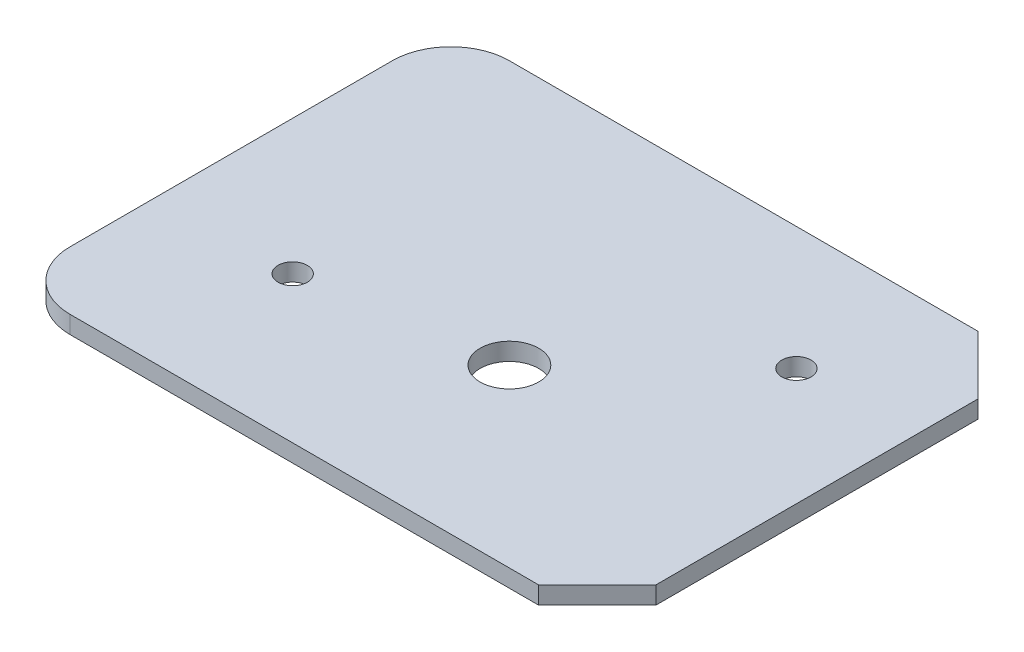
from build123d import *

# Parameters (mm, degrees)
SKETCH1_R      = 2.5
SKETCH1_R_2    = 5
EXTRUDE1_DEPTH = 3


with BuildPart() as part:
    # Sketch1 → Extrude1 (new body)
    with BuildSketch(Plane(origin=(0, 0, 0), x_dir=(1, 0, 0), z_dir=(0, 1, 0))):
        with BuildLine():
            Line((10, 0), (90, 0))
            Line((90, 0), (100, 10))
            Line((100, 10), (100, 65))
            Line((100, 65), (90, 75))
            Line((90, 75), (10, 75))
            ThreePointArc((10, 75), (2.928932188, 72.071067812), (0, 65))
            Line((0, 65), (0, 10))
            ThreePointArc((0, 10), (2.928932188, 2.928932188), (10, 0))
        make_face()
        with Locations(Location((80, 54, 0), (0, 0, 270))):
            Circle(SKETCH1_R, mode=Mode.SUBTRACT)
        with Locations(Location((55, 30, 0), (0, 0, 270))):
            Circle(SKETCH1_R_2, mode=Mode.SUBTRACT)
        with Locations(Location((23, 25, 0), (0, 0, 270))):
            Circle(SKETCH1_R, mode=Mode.SUBTRACT)
    extrude(amount=EXTRUDE1_DEPTH)


solid = part.part
